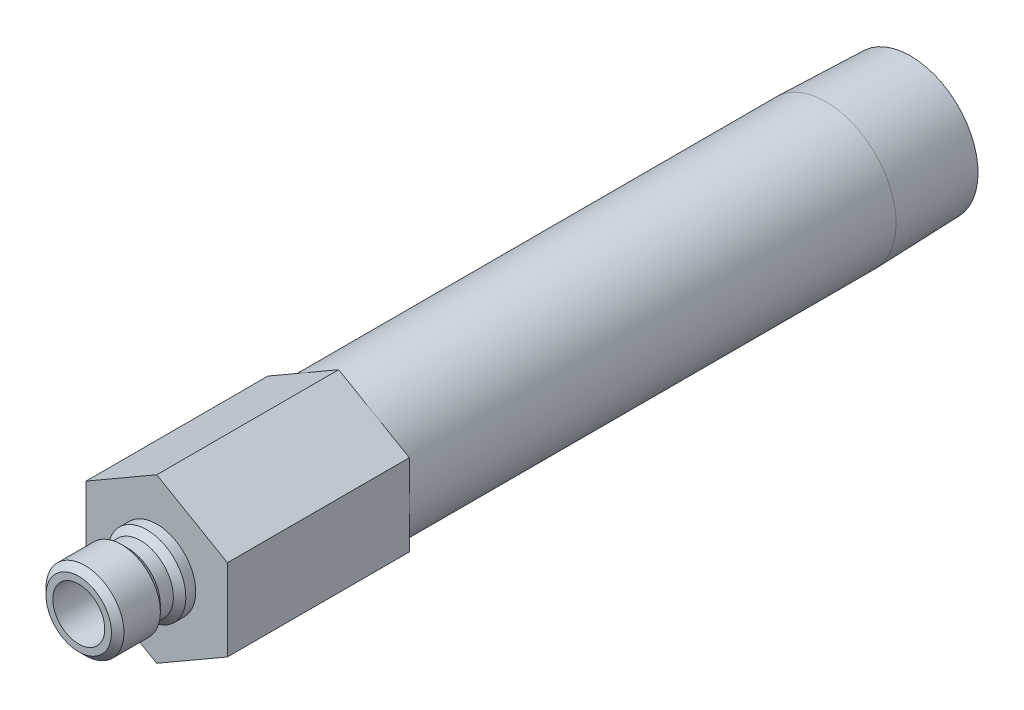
ISO-10303-21;
HEADER;
FILE_DESCRIPTION(('STEP AP214'),'2;1');
FILE_NAME('part.step','',(''),(''),'','','');
FILE_SCHEMA(('AUTOMOTIVE_DESIGN { 1 0 10303 214 1 1 1 1 }'));
ENDSEC;
DATA;
#1=APPLICATION_CONTEXT('core data for automotive mechanical design processes');
#2=APPLICATION_PROTOCOL_DEFINITION('international standard','automotive_design',2000,#1);
#3=PRODUCT_CONTEXT('',#1,'mechanical');
#4=PRODUCT('Part','Part','',(#3));
#5=PRODUCT_RELATED_PRODUCT_CATEGORY('part','',(#4));
#6=PRODUCT_DEFINITION_FORMATION('','',#4);
#7=PRODUCT_DEFINITION_CONTEXT('part definition',#1,'design');
#8=PRODUCT_DEFINITION('design','',#6,#7);
#9=PRODUCT_DEFINITION_SHAPE('','',#8);
#10=(LENGTH_UNIT() NAMED_UNIT(*) SI_UNIT(.MILLI.,.METRE.));
#11=(NAMED_UNIT(*) PLANE_ANGLE_UNIT() SI_UNIT($,.RADIAN.));
#12=(NAMED_UNIT(*) SI_UNIT($,.STERADIAN.) SOLID_ANGLE_UNIT());
#13=UNCERTAINTY_MEASURE_WITH_UNIT(LENGTH_MEASURE(1.E-05),#10,'distance_accuracy_value','');
#14=(GEOMETRIC_REPRESENTATION_CONTEXT(3) GLOBAL_UNCERTAINTY_ASSIGNED_CONTEXT((#13)) GLOBAL_UNIT_ASSIGNED_CONTEXT((#10,
#11,#12)) REPRESENTATION_CONTEXT('',''));
#15=CARTESIAN_POINT('',(0.,0.,0.));
#16=DIRECTION('',(0.,0.,1.));
#17=DIRECTION('',(1.,0.,0.));
#18=AXIS2_PLACEMENT_3D('',#15,#16,#17);
#19=CARTESIAN_POINT('',(0.,0.,0.));
#20=DIRECTION('',(0.,0.,-1.));
#21=DIRECTION('',(0.,1.,0.));
#22=AXIS2_PLACEMENT_3D('',#19,#20,#21);
#23=CYLINDRICAL_SURFACE('',#22,8.57249999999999);
#24=CARTESIAN_POINT('',(0.,0.,-81.7372));
#25=DIRECTION('',(0.,0.,-1.));
#26=DIRECTION('',(0.,1.,0.));
#27=AXIS2_PLACEMENT_3D('',#24,#25,#26);
#28=CIRCLE('',#27,8.57249999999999);
#29=CARTESIAN_POINT('',(0.,8.5725,-81.7372));
#30=VERTEX_POINT('',#29);
#31=EDGE_CURVE('E168',#30,#30,#28,.T.);
#32=ORIENTED_EDGE('',*,*,#31,.F.);
#33=EDGE_LOOP('',(#32));
#34=FACE_BOUND('',#33,.T.);
#35=CARTESIAN_POINT('',(0.,0.,-22.225));
#36=DIRECTION('',(0.,0.,1.));
#37=DIRECTION('',(1.,0.,0.));
#38=AXIS2_PLACEMENT_3D('',#35,#36,#37);
#39=CIRCLE('',#38,8.57249999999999);
#40=CARTESIAN_POINT('',(8.57249999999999,0.,-22.225));
#41=VERTEX_POINT('',#40);
#42=EDGE_CURVE('E37',#41,#41,#39,.F.);
#43=ORIENTED_EDGE('',*,*,#42,.T.);
#44=EDGE_LOOP('',(#43));
#45=FACE_BOUND('',#44,.T.);
#46=ADVANCED_FACE('F33',(#34,#45),#23,.T.);
#47=CARTESIAN_POINT('',(0.,0.,0.));
#48=DIRECTION('',(0.,0.,-1.));
#49=DIRECTION('',(0.,1.,0.));
#50=AXIS2_PLACEMENT_3D('',#47,#48,#49);
#51=CYLINDRICAL_SURFACE('',#50,3.175);
#52=CARTESIAN_POINT('',(0.,0.,9.525));
#53=DIRECTION('',(0.,0.,-1.));
#54=DIRECTION('',(0.,1.,0.));
#55=AXIS2_PLACEMENT_3D('',#52,#53,#54);
#56=CIRCLE('',#55,3.175);
#57=CARTESIAN_POINT('',(0.,3.175,9.525));
#58=VERTEX_POINT('',#57);
#59=EDGE_CURVE('E144',#58,#58,#56,.T.);
#60=ORIENTED_EDGE('',*,*,#59,.F.);
#61=EDGE_LOOP('',(#60));
#62=FACE_BOUND('',#61,.T.);
#63=CARTESIAN_POINT('',(0.,0.,-22.225));
#64=DIRECTION('',(0.,0.,-1.));
#65=DIRECTION('',(0.,1.,0.));
#66=AXIS2_PLACEMENT_3D('',#63,#64,#65);
#67=CIRCLE('',#66,3.17499999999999);
#68=CARTESIAN_POINT('',(0.,3.175,-22.225));
#69=VERTEX_POINT('',#68);
#70=EDGE_CURVE('E11',#69,#69,#67,.T.);
#71=ORIENTED_EDGE('',*,*,#70,.T.);
#72=EDGE_LOOP('',(#71));
#73=FACE_BOUND('',#72,.T.);
#74=ADVANCED_FACE('F35',(#62,#73),#51,.F.);
#75=CARTESIAN_POINT('',(0.,3.175,-22.225));
#76=DIRECTION('',(0.,0.,-1.));
#77=DIRECTION('',(0.,1.,0.));
#78=AXIS2_PLACEMENT_3D('',#75,#76,#77);
#79=PLANE('',#78);
#80=CARTESIAN_POINT('',(0.,0.,-22.225));
#81=DIRECTION('',(0.,0.,-1.));
#82=DIRECTION('',(0.,1.,0.));
#83=AXIS2_PLACEMENT_3D('',#80,#81,#82);
#84=CIRCLE('',#83,6.2611);
#85=CARTESIAN_POINT('',(0.,6.2611,-22.225));
#86=VERTEX_POINT('',#85);
#87=EDGE_CURVE('E43',#86,#86,#84,.T.);
#88=ORIENTED_EDGE('',*,*,#87,.T.);
#89=EDGE_LOOP('',(#88));
#90=FACE_BOUND('',#89,.T.);
#91=ORIENTED_EDGE('',*,*,#70,.F.);
#92=EDGE_LOOP('',(#91));
#93=FACE_BOUND('',#92,.T.);
#94=ADVANCED_FACE('F180',(#90,#93),#79,.T.);
#95=CARTESIAN_POINT('',(0.,0.,0.));
#96=DIRECTION('',(0.,0.,-1.));
#97=DIRECTION('',(0.,1.,0.));
#98=AXIS2_PLACEMENT_3D('',#95,#96,#97);
#99=CYLINDRICAL_SURFACE('',#98,6.26109999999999);
#100=CARTESIAN_POINT('',(0.,0.,-92.075));
#101=DIRECTION('',(0.,0.,-1.));
#102=DIRECTION('',(0.,1.,0.));
#103=AXIS2_PLACEMENT_3D('',#100,#101,#102);
#104=CIRCLE('',#103,6.26109999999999);
#105=CARTESIAN_POINT('',(0.,6.2611,-92.075));
#106=VERTEX_POINT('',#105);
#107=EDGE_CURVE('E174',#106,#106,#104,.T.);
#108=ORIENTED_EDGE('',*,*,#107,.T.);
#109=EDGE_LOOP('',(#108));
#110=FACE_BOUND('',#109,.T.);
#111=ORIENTED_EDGE('',*,*,#87,.F.);
#112=EDGE_LOOP('',(#111));
#113=FACE_BOUND('',#112,.T.);
#114=ADVANCED_FACE('F183',(#110,#113),#99,.F.);
#115=CARTESIAN_POINT('',(0.,8.24944566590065,-92.075));
#116=DIRECTION('',(0.,0.,-1.));
#117=DIRECTION('',(0.,1.,0.));
#118=AXIS2_PLACEMENT_3D('',#115,#116,#117);
#119=PLANE('',#118);
#120=CARTESIAN_POINT('',(0.,0.,-92.075));
#121=DIRECTION('',(0.,0.,-1.));
#122=DIRECTION('',(0.,1.,0.));
#123=AXIS2_PLACEMENT_3D('',#120,#121,#122);
#124=CIRCLE('',#123,8.24944566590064);
#125=CARTESIAN_POINT('',(0.,8.24944566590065,-92.075));
#126=VERTEX_POINT('',#125);
#127=EDGE_CURVE('E171',#126,#126,#124,.T.);
#128=ORIENTED_EDGE('',*,*,#127,.T.);
#129=EDGE_LOOP('',(#128));
#130=FACE_BOUND('',#129,.T.);
#131=ORIENTED_EDGE('',*,*,#107,.F.);
#132=EDGE_LOOP('',(#131));
#133=FACE_BOUND('',#132,.T.);
#134=ADVANCED_FACE('F185',(#130,#133),#119,.T.);
#135=CARTESIAN_POINT('',(0.,0.,-92.075));
#136=DIRECTION('',(0.,0.,1.));
#137=DIRECTION('',(0.,-1.,0.));
#138=AXIS2_PLACEMENT_3D('',#135,#136,#137);
#139=CONICAL_SURFACE('',#138,8.24944566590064,0.0312396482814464);
#140=ORIENTED_EDGE('',*,*,#31,.T.);
#141=EDGE_LOOP('',(#140));
#142=FACE_BOUND('',#141,.T.);
#143=ORIENTED_EDGE('',*,*,#127,.F.);
#144=EDGE_LOOP('',(#143));
#145=FACE_BOUND('',#144,.T.);
#146=ADVANCED_FACE('F192',(#142,#145),#139,.T.);
#147=CARTESIAN_POINT('',(0.,4.7625,0.));
#148=DIRECTION('',(0.,0.,1.));
#149=DIRECTION('',(0.,-1.,0.));
#150=AXIS2_PLACEMENT_3D('',#147,#148,#149);
#151=PLANE('',#150);
#152=CARTESIAN_POINT('',(0.,0.,0.));
#153=DIRECTION('',(0.,0.,-1.));
#154=DIRECTION('',(0.,1.,0.));
#155=AXIS2_PLACEMENT_3D('',#152,#153,#154);
#156=CIRCLE('',#155,4.7625);
#157=CARTESIAN_POINT('',(0.,4.7625,0.));
#158=VERTEX_POINT('',#157);
#159=EDGE_CURVE('E165',#158,#158,#156,.T.);
#160=ORIENTED_EDGE('',*,*,#159,.T.);
#161=EDGE_LOOP('',(#160));
#162=FACE_BOUND('',#161,.T.);
#163=DIRECTION('',(-0.866025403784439,-0.5,0.));
#164=VECTOR('',#163,1.);
#165=CARTESIAN_POINT('',(0.,9.97199384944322,0.));
#166=LINE('',#165,#164);
#167=CARTESIAN_POINT('',(0.,9.97199384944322,0.));
#168=VERTEX_POINT('',#167);
#169=CARTESIAN_POINT('',(-8.636,4.98599692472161,0.));
#170=VERTEX_POINT('',#169);
#171=EDGE_CURVE('E122',#168,#170,#166,.T.);
#172=ORIENTED_EDGE('',*,*,#171,.T.);
#173=DIRECTION('',(0.,-1.,0.));
#174=VECTOR('',#173,1.);
#175=CARTESIAN_POINT('',(-8.636,4.98599692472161,0.));
#176=LINE('',#175,#174);
#177=CARTESIAN_POINT('',(-8.636,-4.98599692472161,0.));
#178=VERTEX_POINT('',#177);
#179=EDGE_CURVE('E125',#170,#178,#176,.T.);
#180=ORIENTED_EDGE('',*,*,#179,.T.);
#181=DIRECTION('',(0.866025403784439,-0.5,0.));
#182=VECTOR('',#181,1.);
#183=CARTESIAN_POINT('',(-8.636,-4.98599692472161,0.));
#184=LINE('',#183,#182);
#185=CARTESIAN_POINT('',(0.,-9.97199384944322,0.));
#186=VERTEX_POINT('',#185);
#187=EDGE_CURVE('E128',#178,#186,#184,.T.);
#188=ORIENTED_EDGE('',*,*,#187,.T.);
#189=DIRECTION('',(0.866025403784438,0.5,0.));
#190=VECTOR('',#189,1.);
#191=CARTESIAN_POINT('',(0.,-9.97199384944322,0.));
#192=LINE('',#191,#190);
#193=CARTESIAN_POINT('',(8.636,-4.98599692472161,0.));
#194=VERTEX_POINT('',#193);
#195=EDGE_CURVE('E131',#186,#194,#192,.T.);
#196=ORIENTED_EDGE('',*,*,#195,.T.);
#197=DIRECTION('',(0.,1.,0.));
#198=VECTOR('',#197,1.);
#199=CARTESIAN_POINT('',(8.636,-4.98599692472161,0.));
#200=LINE('',#199,#198);
#201=CARTESIAN_POINT('',(8.636,4.98599692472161,0.));
#202=VERTEX_POINT('',#201);
#203=EDGE_CURVE('E99',#194,#202,#200,.T.);
#204=ORIENTED_EDGE('',*,*,#203,.T.);
#205=DIRECTION('',(-0.866025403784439,0.5,0.));
#206=VECTOR('',#205,1.);
#207=CARTESIAN_POINT('',(8.636,4.98599692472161,0.));
#208=LINE('',#207,#206);
#209=EDGE_CURVE('E134',#202,#168,#208,.T.);
#210=ORIENTED_EDGE('',*,*,#209,.T.);
#211=EDGE_LOOP('',(#172,#180,#188,#196,#204,#210));
#212=FACE_BOUND('',#211,.T.);
#213=ADVANCED_FACE('F206',(#162,#212),#151,.T.);
#214=CARTESIAN_POINT('',(0.,0.,0.));
#215=DIRECTION('',(0.,0.,-1.));
#216=DIRECTION('',(0.,1.,0.));
#217=AXIS2_PLACEMENT_3D('',#214,#215,#216);
#218=CYLINDRICAL_SURFACE('',#217,4.7625);
#219=CARTESIAN_POINT('',(0.,0.,1.2065));
#220=DIRECTION('',(0.,0.,-1.));
#221=DIRECTION('',(0.,1.,0.));
#222=AXIS2_PLACEMENT_3D('',#219,#220,#221);
#223=CIRCLE('',#222,4.7625);
#224=CARTESIAN_POINT('',(0.,4.7625,1.2065));
#225=VERTEX_POINT('',#224);
#226=EDGE_CURVE('E162',#225,#225,#223,.T.);
#227=ORIENTED_EDGE('',*,*,#226,.T.);
#228=EDGE_LOOP('',(#227));
#229=FACE_BOUND('',#228,.T.);
#230=ORIENTED_EDGE('',*,*,#159,.F.);
#231=EDGE_LOOP('',(#230));
#232=FACE_BOUND('',#231,.T.);
#233=ADVANCED_FACE('F213',(#229,#232),#218,.T.);
#234=CARTESIAN_POINT('',(0.,0.,1.2065));
#235=DIRECTION('',(0.,0.,-1.));
#236=DIRECTION('',(0.,1.,0.));
#237=AXIS2_PLACEMENT_3D('',#234,#235,#236);
#238=CONICAL_SURFACE('',#237,4.7625,0.785398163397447);
#239=CARTESIAN_POINT('',(0.,0.,1.9685));
#240=DIRECTION('',(0.,0.,-1.));
#241=DIRECTION('',(0.,1.,0.));
#242=AXIS2_PLACEMENT_3D('',#239,#240,#241);
#243=CIRCLE('',#242,4.0005);
#244=CARTESIAN_POINT('',(0.,4.0005,1.9685));
#245=VERTEX_POINT('',#244);
#246=EDGE_CURVE('E159',#245,#245,#243,.T.);
#247=ORIENTED_EDGE('',*,*,#246,.T.);
#248=EDGE_LOOP('',(#247));
#249=FACE_BOUND('',#248,.T.);
#250=ORIENTED_EDGE('',*,*,#226,.F.);
#251=EDGE_LOOP('',(#250));
#252=FACE_BOUND('',#251,.T.);
#253=ADVANCED_FACE('F222',(#249,#252),#238,.T.);
#254=CARTESIAN_POINT('',(0.,0.,0.));
#255=DIRECTION('',(0.,0.,-1.));
#256=DIRECTION('',(0.,1.,0.));
#257=AXIS2_PLACEMENT_3D('',#254,#255,#256);
#258=CYLINDRICAL_SURFACE('',#257,4.0005);
#259=CARTESIAN_POINT('',(0.,0.,3.556));
#260=DIRECTION('',(0.,0.,-1.));
#261=DIRECTION('',(0.,1.,0.));
#262=AXIS2_PLACEMENT_3D('',#259,#260,#261);
#263=CIRCLE('',#262,4.0005);
#264=CARTESIAN_POINT('',(0.,4.0005,3.556));
#265=VERTEX_POINT('',#264);
#266=EDGE_CURVE('E156',#265,#265,#263,.T.);
#267=ORIENTED_EDGE('',*,*,#266,.T.);
#268=EDGE_LOOP('',(#267));
#269=FACE_BOUND('',#268,.T.);
#270=ORIENTED_EDGE('',*,*,#246,.F.);
#271=EDGE_LOOP('',(#270));
#272=FACE_BOUND('',#271,.T.);
#273=ADVANCED_FACE('F263',(#269,#272),#258,.T.);
#274=CARTESIAN_POINT('',(0.,0.,3.556));
#275=DIRECTION('',(0.,0.,1.));
#276=DIRECTION('',(0.,-1.,0.));
#277=AXIS2_PLACEMENT_3D('',#274,#275,#276);
#278=CONICAL_SURFACE('',#277,4.0005,0.785398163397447);
#279=CARTESIAN_POINT('',(0.,0.,4.318));
#280=DIRECTION('',(0.,0.,-1.));
#281=DIRECTION('',(0.,1.,0.));
#282=AXIS2_PLACEMENT_3D('',#279,#280,#281);
#283=CIRCLE('',#282,4.7625);
#284=CARTESIAN_POINT('',(0.,4.7625,4.318));
#285=VERTEX_POINT('',#284);
#286=EDGE_CURVE('E153',#285,#285,#283,.T.);
#287=ORIENTED_EDGE('',*,*,#286,.T.);
#288=EDGE_LOOP('',(#287));
#289=FACE_BOUND('',#288,.T.);
#290=ORIENTED_EDGE('',*,*,#266,.F.);
#291=EDGE_LOOP('',(#290));
#292=FACE_BOUND('',#291,.T.);
#293=ADVANCED_FACE('F259',(#289,#292),#278,.T.);
#294=CARTESIAN_POINT('',(0.,0.,0.));
#295=DIRECTION('',(0.,0.,-1.));
#296=DIRECTION('',(0.,1.,0.));
#297=AXIS2_PLACEMENT_3D('',#294,#295,#296);
#298=CYLINDRICAL_SURFACE('',#297,4.7625);
#299=CARTESIAN_POINT('',(0.,0.,8.763));
#300=DIRECTION('',(0.,0.,-1.));
#301=DIRECTION('',(0.,1.,0.));
#302=AXIS2_PLACEMENT_3D('',#299,#300,#301);
#303=CIRCLE('',#302,4.7625);
#304=CARTESIAN_POINT('',(0.,4.7625,8.763));
#305=VERTEX_POINT('',#304);
#306=EDGE_CURVE('E150',#305,#305,#303,.T.);
#307=ORIENTED_EDGE('',*,*,#306,.T.);
#308=EDGE_LOOP('',(#307));
#309=FACE_BOUND('',#308,.T.);
#310=ORIENTED_EDGE('',*,*,#286,.F.);
#311=EDGE_LOOP('',(#310));
#312=FACE_BOUND('',#311,.T.);
#313=ADVANCED_FACE('F255',(#309,#312),#298,.T.);
#314=CARTESIAN_POINT('',(0.,0.,8.763));
#315=DIRECTION('',(0.,0.,-1.));
#316=DIRECTION('',(0.,1.,0.));
#317=AXIS2_PLACEMENT_3D('',#314,#315,#316);
#318=CONICAL_SURFACE('',#317,4.7625,0.785398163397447);
#319=CARTESIAN_POINT('',(0.,0.,9.525));
#320=DIRECTION('',(0.,0.,-1.));
#321=DIRECTION('',(0.,1.,0.));
#322=AXIS2_PLACEMENT_3D('',#319,#320,#321);
#323=CIRCLE('',#322,4.0005);
#324=CARTESIAN_POINT('',(0.,4.0005,9.525));
#325=VERTEX_POINT('',#324);
#326=EDGE_CURVE('E147',#325,#325,#323,.T.);
#327=ORIENTED_EDGE('',*,*,#326,.T.);
#328=EDGE_LOOP('',(#327));
#329=FACE_BOUND('',#328,.T.);
#330=ORIENTED_EDGE('',*,*,#306,.F.);
#331=EDGE_LOOP('',(#330));
#332=FACE_BOUND('',#331,.T.);
#333=ADVANCED_FACE('F251',(#329,#332),#318,.T.);
#334=CARTESIAN_POINT('',(0.,3.175,9.525));
#335=DIRECTION('',(0.,0.,1.));
#336=DIRECTION('',(0.,-1.,0.));
#337=AXIS2_PLACEMENT_3D('',#334,#335,#336);
#338=PLANE('',#337);
#339=ORIENTED_EDGE('',*,*,#59,.T.);
#340=EDGE_LOOP('',(#339));
#341=FACE_BOUND('',#340,.T.);
#342=ORIENTED_EDGE('',*,*,#326,.F.);
#343=EDGE_LOOP('',(#342));
#344=FACE_BOUND('',#343,.T.);
#345=ADVANCED_FACE('F239',(#341,#344),#338,.T.);
#346=CARTESIAN_POINT('',(0.,9.97199384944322,-22.225));
#347=DIRECTION('',(-0.5,0.866025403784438,0.));
#348=DIRECTION('',(-0.866025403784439,-0.5,0.));
#349=AXIS2_PLACEMENT_3D('',#346,#347,#348);
#350=PLANE('',#349);
#351=ORIENTED_EDGE('',*,*,#171,.F.);
#352=DIRECTION('',(0.,0.,1.));
#353=VECTOR('',#352,1.);
#354=CARTESIAN_POINT('',(0.,9.97199384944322,-22.225));
#355=LINE('',#354,#353);
#356=CARTESIAN_POINT('',(0.,9.97199384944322,-22.225));
#357=VERTEX_POINT('',#356);
#358=EDGE_CURVE('E51',#357,#168,#355,.T.);
#359=ORIENTED_EDGE('',*,*,#358,.F.);
#360=DIRECTION('',(-0.866025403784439,-0.5,0.));
#361=VECTOR('',#360,1.);
#362=CARTESIAN_POINT('',(0.,9.97199384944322,-22.225));
#363=LINE('',#362,#361);
#364=CARTESIAN_POINT('',(-8.636,4.98599692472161,-22.225));
#365=VERTEX_POINT('',#364);
#366=EDGE_CURVE('E137',#357,#365,#363,.T.);
#367=ORIENTED_EDGE('',*,*,#366,.T.);
#368=DIRECTION('',(0.,0.,1.));
#369=VECTOR('',#368,1.);
#370=CARTESIAN_POINT('',(-8.636,4.98599692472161,-22.225));
#371=LINE('',#370,#369);
#372=EDGE_CURVE('E86',#365,#170,#371,.T.);
#373=ORIENTED_EDGE('',*,*,#372,.T.);
#374=EDGE_LOOP('',(#351,#359,#367,#373));
#375=FACE_BOUND('',#374,.T.);
#376=ADVANCED_FACE('F226',(#375),#350,.T.);
#377=CARTESIAN_POINT('',(8.636,4.98599692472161,-22.225));
#378=DIRECTION('',(0.5,0.866025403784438,0.));
#379=DIRECTION('',(-0.866025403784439,0.5,0.));
#380=AXIS2_PLACEMENT_3D('',#377,#378,#379);
#381=PLANE('',#380);
#382=ORIENTED_EDGE('',*,*,#209,.F.);
#383=DIRECTION('',(0.,0.,1.));
#384=VECTOR('',#383,1.);
#385=CARTESIAN_POINT('',(8.636,4.98599692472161,-22.225));
#386=LINE('',#385,#384);
#387=CARTESIAN_POINT('',(8.636,4.98599692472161,-22.225));
#388=VERTEX_POINT('',#387);
#389=EDGE_CURVE('E74',#388,#202,#386,.T.);
#390=ORIENTED_EDGE('',*,*,#389,.F.);
#391=DIRECTION('',(-0.866025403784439,0.5,0.));
#392=VECTOR('',#391,1.);
#393=CARTESIAN_POINT('',(8.636,4.98599692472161,-22.225));
#394=LINE('',#393,#392);
#395=EDGE_CURVE('E112',#388,#357,#394,.T.);
#396=ORIENTED_EDGE('',*,*,#395,.T.);
#397=ORIENTED_EDGE('',*,*,#358,.T.);
#398=EDGE_LOOP('',(#382,#390,#396,#397));
#399=FACE_BOUND('',#398,.T.);
#400=ADVANCED_FACE('F231',(#399),#381,.T.);
#401=CARTESIAN_POINT('',(8.636,-4.98599692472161,-22.225));
#402=DIRECTION('',(1.,0.,0.));
#403=DIRECTION('',(0.,1.,0.));
#404=AXIS2_PLACEMENT_3D('',#401,#402,#403);
#405=PLANE('',#404);
#406=ORIENTED_EDGE('',*,*,#203,.F.);
#407=DIRECTION('',(0.,0.,1.));
#408=VECTOR('',#407,1.);
#409=CARTESIAN_POINT('',(8.636,-4.98599692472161,-22.225));
#410=LINE('',#409,#408);
#411=CARTESIAN_POINT('',(8.636,-4.98599692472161,-22.225));
#412=VERTEX_POINT('',#411);
#413=EDGE_CURVE('E94',#412,#194,#410,.T.);
#414=ORIENTED_EDGE('',*,*,#413,.F.);
#415=DIRECTION('',(0.,1.,0.));
#416=VECTOR('',#415,1.);
#417=CARTESIAN_POINT('',(8.636,-4.98599692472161,-22.225));
#418=LINE('',#417,#416);
#419=EDGE_CURVE('E97',#412,#388,#418,.T.);
#420=ORIENTED_EDGE('',*,*,#419,.T.);
#421=ORIENTED_EDGE('',*,*,#389,.T.);
#422=EDGE_LOOP('',(#406,#414,#420,#421));
#423=FACE_BOUND('',#422,.T.);
#424=ADVANCED_FACE('F96',(#423),#405,.T.);
#425=CARTESIAN_POINT('',(0.,-9.97199384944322,-22.225));
#426=DIRECTION('',(0.5,-0.866025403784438,0.));
#427=DIRECTION('',(0.866025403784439,0.5,0.));
#428=AXIS2_PLACEMENT_3D('',#425,#426,#427);
#429=PLANE('',#428);
#430=ORIENTED_EDGE('',*,*,#195,.F.);
#431=DIRECTION('',(0.,0.,1.));
#432=VECTOR('',#431,1.);
#433=CARTESIAN_POINT('',(0.,-9.97199384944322,-22.225));
#434=LINE('',#433,#432);
#435=CARTESIAN_POINT('',(0.,-9.97199384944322,-22.225));
#436=VERTEX_POINT('',#435);
#437=EDGE_CURVE('E104',#436,#186,#434,.T.);
#438=ORIENTED_EDGE('',*,*,#437,.F.);
#439=DIRECTION('',(0.866025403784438,0.5,0.));
#440=VECTOR('',#439,1.);
#441=CARTESIAN_POINT('',(0.,-9.97199384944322,-22.225));
#442=LINE('',#441,#440);
#443=EDGE_CURVE('E110',#436,#412,#442,.T.);
#444=ORIENTED_EDGE('',*,*,#443,.T.);
#445=ORIENTED_EDGE('',*,*,#413,.T.);
#446=EDGE_LOOP('',(#430,#438,#444,#445));
#447=FACE_BOUND('',#446,.T.);
#448=ADVANCED_FACE('F114',(#447),#429,.T.);
#449=CARTESIAN_POINT('',(-8.636,-4.98599692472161,-22.225));
#450=DIRECTION('',(-0.5,-0.866025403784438,0.));
#451=DIRECTION('',(0.866025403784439,-0.5,0.));
#452=AXIS2_PLACEMENT_3D('',#449,#450,#451);
#453=PLANE('',#452);
#454=ORIENTED_EDGE('',*,*,#187,.F.);
#455=DIRECTION('',(0.,0.,1.));
#456=VECTOR('',#455,1.);
#457=CARTESIAN_POINT('',(-8.636,-4.98599692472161,-22.225));
#458=LINE('',#457,#456);
#459=CARTESIAN_POINT('',(-8.636,-4.98599692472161,-22.225));
#460=VERTEX_POINT('',#459);
#461=EDGE_CURVE('E141',#460,#178,#458,.T.);
#462=ORIENTED_EDGE('',*,*,#461,.F.);
#463=DIRECTION('',(0.866025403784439,-0.5,0.));
#464=VECTOR('',#463,1.);
#465=CARTESIAN_POINT('',(-8.636,-4.98599692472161,-22.225));
#466=LINE('',#465,#464);
#467=EDGE_CURVE('E115',#460,#436,#466,.T.);
#468=ORIENTED_EDGE('',*,*,#467,.T.);
#469=ORIENTED_EDGE('',*,*,#437,.T.);
#470=EDGE_LOOP('',(#454,#462,#468,#469));
#471=FACE_BOUND('',#470,.T.);
#472=ADVANCED_FACE('F230',(#471),#453,.T.);
#473=CARTESIAN_POINT('',(-8.636,4.98599692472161,-22.225));
#474=DIRECTION('',(-1.,0.,0.));
#475=DIRECTION('',(0.,0.,1.));
#476=AXIS2_PLACEMENT_3D('',#473,#474,#475);
#477=PLANE('',#476);
#478=ORIENTED_EDGE('',*,*,#179,.F.);
#479=ORIENTED_EDGE('',*,*,#372,.F.);
#480=DIRECTION('',(0.,-1.,0.));
#481=VECTOR('',#480,1.);
#482=CARTESIAN_POINT('',(-8.636,4.98599692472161,-22.225));
#483=LINE('',#482,#481);
#484=EDGE_CURVE('E117',#365,#460,#483,.T.);
#485=ORIENTED_EDGE('',*,*,#484,.T.);
#486=ORIENTED_EDGE('',*,*,#461,.T.);
#487=EDGE_LOOP('',(#478,#479,#485,#486));
#488=FACE_BOUND('',#487,.T.);
#489=ADVANCED_FACE('F227',(#488),#477,.T.);
#490=CARTESIAN_POINT('',(-8.636,4.98599692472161,-22.225));
#491=DIRECTION('',(0.,0.,1.));
#492=DIRECTION('',(1.,0.,0.));
#493=AXIS2_PLACEMENT_3D('',#490,#491,#492);
#494=PLANE('',#493);
#495=ORIENTED_EDGE('',*,*,#42,.F.);
#496=EDGE_LOOP('',(#495));
#497=FACE_BOUND('',#496,.T.);
#498=ORIENTED_EDGE('',*,*,#366,.F.);
#499=ORIENTED_EDGE('',*,*,#395,.F.);
#500=ORIENTED_EDGE('',*,*,#419,.F.);
#501=ORIENTED_EDGE('',*,*,#443,.F.);
#502=ORIENTED_EDGE('',*,*,#467,.F.);
#503=ORIENTED_EDGE('',*,*,#484,.F.);
#504=EDGE_LOOP('',(#498,#499,#500,#501,#502,#503));
#505=FACE_BOUND('',#504,.T.);
#506=ADVANCED_FACE('F108',(#497,#505),#494,.F.);
#507=CLOSED_SHELL('',(#46,#74,#94,#114,#134,#146,#213,#233,#253,#273,#293,#313,#333,#345,#376,
#400,#424,#448,#472,#489,#506));
#508=MANIFOLD_SOLID_BREP('B2',#507);
#509=ADVANCED_BREP_SHAPE_REPRESENTATION('',(#18,#508),#14);
#510=SHAPE_DEFINITION_REPRESENTATION(#9,#509);
ENDSEC;
END-ISO-10303-21;
